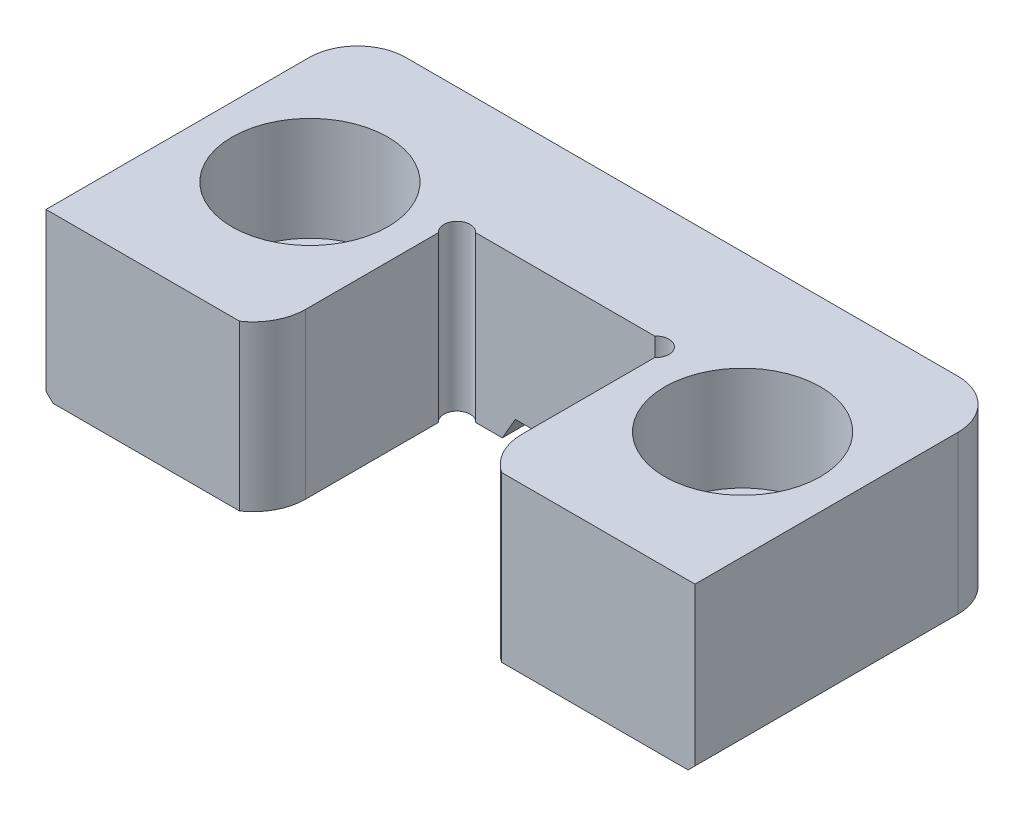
ISO-10303-21;
HEADER;
FILE_DESCRIPTION(('STEP AP214'),'2;1');
FILE_NAME('part.step','',(''),(''),'','','');
FILE_SCHEMA(('AUTOMOTIVE_DESIGN { 1 0 10303 214 1 1 1 1 }'));
ENDSEC;
DATA;
#1=APPLICATION_CONTEXT('core data for automotive mechanical design processes');
#2=APPLICATION_PROTOCOL_DEFINITION('international standard','automotive_design',2000,#1);
#3=PRODUCT_CONTEXT('',#1,'mechanical');
#4=PRODUCT('Part','Part','',(#3));
#5=PRODUCT_RELATED_PRODUCT_CATEGORY('part','',(#4));
#6=PRODUCT_DEFINITION_FORMATION('','',#4);
#7=PRODUCT_DEFINITION_CONTEXT('part definition',#1,'design');
#8=PRODUCT_DEFINITION('design','',#6,#7);
#9=PRODUCT_DEFINITION_SHAPE('','',#8);
#10=(LENGTH_UNIT() NAMED_UNIT(*) SI_UNIT(.MILLI.,.METRE.));
#11=(NAMED_UNIT(*) PLANE_ANGLE_UNIT() SI_UNIT($,.RADIAN.));
#12=(NAMED_UNIT(*) SI_UNIT($,.STERADIAN.) SOLID_ANGLE_UNIT());
#13=UNCERTAINTY_MEASURE_WITH_UNIT(LENGTH_MEASURE(1.E-05),#10,'distance_accuracy_value','');
#14=(GEOMETRIC_REPRESENTATION_CONTEXT(3) GLOBAL_UNCERTAINTY_ASSIGNED_CONTEXT((#13)) GLOBAL_UNIT_ASSIGNED_CONTEXT((#10,
#11,#12)) REPRESENTATION_CONTEXT('',''));
#15=CARTESIAN_POINT('',(0.,0.,0.));
#16=DIRECTION('',(0.,0.,1.));
#17=DIRECTION('',(1.,0.,0.));
#18=AXIS2_PLACEMENT_3D('',#15,#16,#17);
#19=CARTESIAN_POINT('',(-37.5,-19.,-36.));
#20=DIRECTION('',(0.,-1.,0.));
#21=DIRECTION('',(0.,0.,-1.));
#22=AXIS2_PLACEMENT_3D('',#19,#20,#21);
#23=PLANE('',#22);
#24=CARTESIAN_POINT('',(-25.,-19.,-18.));
#25=DIRECTION('',(0.,1.,0.));
#26=DIRECTION('',(0.,0.,1.));
#27=AXIS2_PLACEMENT_3D('',#24,#25,#26);
#28=CIRCLE('',#27,5.49999999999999);
#29=CARTESIAN_POINT('',(-25.,-19.,-12.5));
#30=VERTEX_POINT('',#29);
#31=EDGE_CURVE('E203',#30,#30,#28,.T.);
#32=ORIENTED_EDGE('',*,*,#31,.T.);
#33=EDGE_LOOP('',(#32));
#34=FACE_BOUND('',#33,.T.);
#35=CARTESIAN_POINT('',(-31.9,-19.,-30.4));
#36=DIRECTION('',(0.,-1.,0.));
#37=DIRECTION('',(0.,0.,-1.));
#38=AXIS2_PLACEMENT_3D('',#35,#36,#37);
#39=CIRCLE('',#38,4.79999999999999);
#40=CARTESIAN_POINT('',(-36.7,-19.,-30.4));
#41=VERTEX_POINT('',#40);
#42=CARTESIAN_POINT('',(-31.9,-19.,-35.2));
#43=VERTEX_POINT('',#42);
#44=EDGE_CURVE('E341',#41,#43,#39,.T.);
#45=ORIENTED_EDGE('',*,*,#44,.T.);
#46=DIRECTION('',(1.,0.,0.));
#47=VECTOR('',#46,1.);
#48=CARTESIAN_POINT('',(-37.5,-19.,-35.2));
#49=LINE('',#48,#47);
#50=CARTESIAN_POINT('',(-7.2679869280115,-19.,-35.2));
#51=VERTEX_POINT('',#50);
#52=EDGE_CURVE('E343',#43,#51,#49,.T.);
#53=ORIENTED_EDGE('',*,*,#52,.T.);
#54=DIRECTION('',(0.,0.,-1.));
#55=VECTOR('',#54,1.);
#56=CARTESIAN_POINT('',(-7.2679869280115,-19.,-36.));
#57=LINE('',#56,#55);
#58=CARTESIAN_POINT('',(-7.2679869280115,-19.,-22.5));
#59=VERTEX_POINT('',#58);
#60=EDGE_CURVE('E325',#59,#51,#57,.T.);
#61=ORIENTED_EDGE('',*,*,#60,.F.);
#62=DIRECTION('',(1.,0.,0.));
#63=VECTOR('',#62,1.);
#64=CARTESIAN_POINT('',(-12.499,-19.,-22.5));
#65=LINE('',#64,#63);
#66=CARTESIAN_POINT('',(-10.3530862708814,-19.,-22.5));
#67=VERTEX_POINT('',#66);
#68=EDGE_CURVE('E275',#67,#59,#65,.T.);
#69=ORIENTED_EDGE('',*,*,#68,.F.);
#70=CARTESIAN_POINT('',(-11.489,-19.,-21.49));
#71=DIRECTION('',(0.,1.,0.));
#72=DIRECTION('',(0.,0.,1.));
#73=AXIS2_PLACEMENT_3D('',#70,#71,#72);
#74=CIRCLE('',#73,1.52);
#75=CARTESIAN_POINT('',(-12.499,-19.,-20.3540862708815));
#76=VERTEX_POINT('',#75);
#77=EDGE_CURVE('E237',#67,#76,#74,.T.);
#78=ORIENTED_EDGE('',*,*,#77,.T.);
#79=DIRECTION('',(0.,0.,-1.));
#80=VECTOR('',#79,1.);
#81=CARTESIAN_POINT('',(-12.499,-19.,0.));
#82=LINE('',#81,#80);
#83=CARTESIAN_POINT('',(-12.499,-19.,-5.));
#84=VERTEX_POINT('',#83);
#85=EDGE_CURVE('E270',#84,#76,#82,.T.);
#86=ORIENTED_EDGE('',*,*,#85,.F.);
#87=CARTESIAN_POINT('',(-18.5522036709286,-19.,-5.));
#88=DIRECTION('',(0.,-1.,0.));
#89=DIRECTION('',(0.,0.,1.));
#90=AXIS2_PLACEMENT_3D('',#87,#88,#89);
#91=CIRCLE('',#90,6.05320367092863);
#92=CARTESIAN_POINT('',(-15.1402724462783,-19.,0.));
#93=VERTEX_POINT('',#92);
#94=EDGE_CURVE('E246',#84,#93,#91,.T.);
#95=ORIENTED_EDGE('',*,*,#94,.T.);
#96=DIRECTION('',(1.,0.,0.));
#97=VECTOR('',#96,1.);
#98=CARTESIAN_POINT('',(-37.5,-19.,0.));
#99=LINE('',#98,#97);
#100=CARTESIAN_POINT('',(-36.7,-19.,0.));
#101=VERTEX_POINT('',#100);
#102=EDGE_CURVE('E268',#101,#93,#99,.T.);
#103=ORIENTED_EDGE('',*,*,#102,.F.);
#104=DIRECTION('',(0.,0.,-1.));
#105=VECTOR('',#104,1.);
#106=CARTESIAN_POINT('',(-36.7,-19.,-36.));
#107=LINE('',#106,#105);
#108=EDGE_CURVE('E339',#101,#41,#107,.T.);
#109=ORIENTED_EDGE('',*,*,#108,.T.);
#110=EDGE_LOOP('',(#45,#53,#61,#69,#78,#86,#95,#103,#109));
#111=FACE_BOUND('',#110,.T.);
#112=ADVANCED_FACE('F35',(#34,#111),#23,.T.);
#113=CARTESIAN_POINT('',(-37.5,-19.,0.));
#114=DIRECTION('',(-1.,0.,0.));
#115=DIRECTION('',(0.,0.,1.));
#116=AXIS2_PLACEMENT_3D('',#113,#114,#115);
#117=PLANE('',#116);
#118=DIRECTION('',(0.,1.,0.));
#119=VECTOR('',#118,1.);
#120=CARTESIAN_POINT('',(-37.5,-19.,-30.4));
#121=LINE('',#120,#119);
#122=CARTESIAN_POINT('',(-37.5,0.,-30.4));
#123=VERTEX_POINT('',#122);
#124=CARTESIAN_POINT('',(-37.5,-18.2,-30.4));
#125=VERTEX_POINT('',#124);
#126=EDGE_CURVE('E317',#123,#125,#121,.F.);
#127=ORIENTED_EDGE('',*,*,#126,.T.);
#128=DIRECTION('',(0.,0.,1.));
#129=VECTOR('',#128,1.);
#130=CARTESIAN_POINT('',(-37.5,-18.2,0.));
#131=LINE('',#130,#129);
#132=CARTESIAN_POINT('',(-37.5,-18.2,0.));
#133=VERTEX_POINT('',#132);
#134=EDGE_CURVE('E348',#125,#133,#131,.T.);
#135=ORIENTED_EDGE('',*,*,#134,.T.);
#136=DIRECTION('',(0.,1.,0.));
#137=VECTOR('',#136,1.);
#138=CARTESIAN_POINT('',(-37.5,-19.,0.));
#139=LINE('',#138,#137);
#140=CARTESIAN_POINT('',(-37.5,0.,0.));
#141=VERTEX_POINT('',#140);
#142=EDGE_CURVE('E282',#133,#141,#139,.T.);
#143=ORIENTED_EDGE('',*,*,#142,.T.);
#144=DIRECTION('',(0.,0.,1.));
#145=VECTOR('',#144,1.);
#146=CARTESIAN_POINT('',(-37.5,0.,0.));
#147=LINE('',#146,#145);
#148=EDGE_CURVE('E260',#123,#141,#147,.T.);
#149=ORIENTED_EDGE('',*,*,#148,.F.);
#150=EDGE_LOOP('',(#127,#135,#143,#149));
#151=FACE_BOUND('',#150,.T.);
#152=ADVANCED_FACE('F444',(#151),#117,.T.);
#153=CARTESIAN_POINT('',(-37.5,-19.,-36.));
#154=DIRECTION('',(0.,0.,-1.));
#155=DIRECTION('',(-1.,0.,0.));
#156=AXIS2_PLACEMENT_3D('',#153,#154,#155);
#157=PLANE('',#156);
#158=DIRECTION('',(0.499999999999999,0.866025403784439,0.));
#159=VECTOR('',#158,1.);
#160=CARTESIAN_POINT('',(-6.35,-17.41,-36.));
#161=LINE('',#160,#159);
#162=CARTESIAN_POINT('',(-6.8061067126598,-18.2,-36.));
#163=VERTEX_POINT('',#162);
#164=CARTESIAN_POINT('',(-6.35,-17.41,-36.));
#165=VERTEX_POINT('',#164);
#166=EDGE_CURVE('E190',#163,#165,#161,.T.);
#167=ORIENTED_EDGE('',*,*,#166,.F.);
#168=DIRECTION('',(-1.,0.,0.));
#169=VECTOR('',#168,1.);
#170=CARTESIAN_POINT('',(-37.5,-18.2,-36.));
#171=LINE('',#170,#169);
#172=CARTESIAN_POINT('',(-31.9,-18.2,-36.));
#173=VERTEX_POINT('',#172);
#174=EDGE_CURVE('E337',#163,#173,#171,.T.);
#175=ORIENTED_EDGE('',*,*,#174,.T.);
#176=DIRECTION('',(0.,1.,0.));
#177=VECTOR('',#176,1.);
#178=CARTESIAN_POINT('',(-31.9,-19.,-36.));
#179=LINE('',#178,#177);
#180=CARTESIAN_POINT('',(-31.9,0.,-36.));
#181=VERTEX_POINT('',#180);
#182=EDGE_CURVE('E312',#173,#181,#179,.T.);
#183=ORIENTED_EDGE('',*,*,#182,.T.);
#184=DIRECTION('',(-1.,0.,0.));
#185=VECTOR('',#184,1.);
#186=CARTESIAN_POINT('',(-37.5,0.,-36.));
#187=LINE('',#186,#185);
#188=CARTESIAN_POINT('',(31.9,0.,-36.));
#189=VERTEX_POINT('',#188);
#190=EDGE_CURVE('E271',#189,#181,#187,.T.);
#191=ORIENTED_EDGE('',*,*,#190,.F.);
#192=DIRECTION('',(0.,1.,0.));
#193=VECTOR('',#192,1.);
#194=CARTESIAN_POINT('',(31.9,-19.,-36.));
#195=LINE('',#194,#193);
#196=CARTESIAN_POINT('',(31.9,-18.2,-36.));
#197=VERTEX_POINT('',#196);
#198=EDGE_CURVE('E314',#189,#197,#195,.F.);
#199=ORIENTED_EDGE('',*,*,#198,.T.);
#200=DIRECTION('',(-1.,0.,0.));
#201=VECTOR('',#200,1.);
#202=CARTESIAN_POINT('',(-37.5,-18.2,-36.));
#203=LINE('',#202,#201);
#204=CARTESIAN_POINT('',(6.80610671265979,-18.2,-36.));
#205=VERTEX_POINT('',#204);
#206=EDGE_CURVE('E335',#197,#205,#203,.T.);
#207=ORIENTED_EDGE('',*,*,#206,.T.);
#208=DIRECTION('',(0.499999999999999,-0.866025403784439,0.));
#209=VECTOR('',#208,1.);
#210=CARTESIAN_POINT('',(6.35,-17.41,-36.));
#211=LINE('',#210,#209);
#212=CARTESIAN_POINT('',(6.35,-17.41,-36.));
#213=VERTEX_POINT('',#212);
#214=EDGE_CURVE('E214',#213,#205,#211,.T.);
#215=ORIENTED_EDGE('',*,*,#214,.F.);
#216=DIRECTION('',(1.,0.,0.));
#217=VECTOR('',#216,1.);
#218=CARTESIAN_POINT('',(6.35,-17.41,-36.));
#219=LINE('',#218,#217);
#220=EDGE_CURVE('E202',#165,#213,#219,.T.);
#221=ORIENTED_EDGE('',*,*,#220,.F.);
#222=EDGE_LOOP('',(#167,#175,#183,#191,#199,#207,#215,#221));
#223=FACE_BOUND('',#222,.T.);
#224=ADVANCED_FACE('F216',(#223),#157,.T.);
#225=CARTESIAN_POINT('',(37.5,-19.,0.));
#226=DIRECTION('',(1.,0.,0.));
#227=DIRECTION('',(0.,0.,-1.));
#228=AXIS2_PLACEMENT_3D('',#225,#226,#227);
#229=PLANE('',#228);
#230=DIRECTION('',(0.,1.,0.));
#231=VECTOR('',#230,1.);
#232=CARTESIAN_POINT('',(37.5,-19.,0.));
#233=LINE('',#232,#231);
#234=CARTESIAN_POINT('',(37.5,-18.2,0.));
#235=VERTEX_POINT('',#234);
#236=CARTESIAN_POINT('',(37.5,0.,0.));
#237=VERTEX_POINT('',#236);
#238=EDGE_CURVE('E303',#235,#237,#233,.T.);
#239=ORIENTED_EDGE('',*,*,#238,.F.);
#240=DIRECTION('',(0.,0.,-1.));
#241=VECTOR('',#240,1.);
#242=CARTESIAN_POINT('',(37.5,-18.2,0.));
#243=LINE('',#242,#241);
#244=CARTESIAN_POINT('',(37.5,-18.2,-30.4));
#245=VERTEX_POINT('',#244);
#246=EDGE_CURVE('E44',#235,#245,#243,.T.);
#247=ORIENTED_EDGE('',*,*,#246,.T.);
#248=DIRECTION('',(0.,1.,0.));
#249=VECTOR('',#248,1.);
#250=CARTESIAN_POINT('',(37.5,-19.,-30.4));
#251=LINE('',#250,#249);
#252=CARTESIAN_POINT('',(37.5,0.,-30.4));
#253=VERTEX_POINT('',#252);
#254=EDGE_CURVE('E305',#245,#253,#251,.T.);
#255=ORIENTED_EDGE('',*,*,#254,.T.);
#256=DIRECTION('',(0.,0.,-1.));
#257=VECTOR('',#256,1.);
#258=CARTESIAN_POINT('',(37.5,0.,0.));
#259=LINE('',#258,#257);
#260=EDGE_CURVE('E298',#237,#253,#259,.T.);
#261=ORIENTED_EDGE('',*,*,#260,.F.);
#262=EDGE_LOOP('',(#239,#247,#255,#261));
#263=FACE_BOUND('',#262,.T.);
#264=ADVANCED_FACE('F436',(#263),#229,.T.);
#265=CARTESIAN_POINT('',(12.499,-19.,0.));
#266=DIRECTION('',(0.,0.,1.));
#267=DIRECTION('',(1.,0.,0.));
#268=AXIS2_PLACEMENT_3D('',#265,#266,#267);
#269=PLANE('',#268);
#270=DIRECTION('',(1.,0.,0.));
#271=VECTOR('',#270,1.);
#272=CARTESIAN_POINT('',(12.499,-19.,0.));
#273=LINE('',#272,#271);
#274=CARTESIAN_POINT('',(15.1402724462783,-19.,0.));
#275=VERTEX_POINT('',#274);
#276=CARTESIAN_POINT('',(36.7,-19.,0.));
#277=VERTEX_POINT('',#276);
#278=EDGE_CURVE('E280',#275,#277,#273,.T.);
#279=ORIENTED_EDGE('',*,*,#278,.T.);
#280=DIRECTION('',(-0.707106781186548,-0.707106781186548,0.));
#281=VECTOR('',#280,1.);
#282=CARTESIAN_POINT('',(24.5995,-31.1005,0.));
#283=LINE('',#282,#281);
#284=EDGE_CURVE('E11',#277,#235,#283,.F.);
#285=ORIENTED_EDGE('',*,*,#284,.T.);
#286=ORIENTED_EDGE('',*,*,#238,.T.);
#287=DIRECTION('',(1.,0.,0.));
#288=VECTOR('',#287,1.);
#289=CARTESIAN_POINT('',(12.499,0.,0.));
#290=LINE('',#289,#288);
#291=CARTESIAN_POINT('',(15.1402724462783,0.,0.));
#292=VERTEX_POINT('',#291);
#293=EDGE_CURVE('E295',#292,#237,#290,.T.);
#294=ORIENTED_EDGE('',*,*,#293,.F.);
#295=DIRECTION('',(0.,1.,0.));
#296=VECTOR('',#295,1.);
#297=CARTESIAN_POINT('',(15.1402724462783,-19.,0.));
#298=LINE('',#297,#296);
#299=EDGE_CURVE('E264',#275,#292,#298,.T.);
#300=ORIENTED_EDGE('',*,*,#299,.F.);
#301=EDGE_LOOP('',(#279,#285,#286,#294,#300));
#302=FACE_BOUND('',#301,.T.);
#303=ADVANCED_FACE('F387',(#302),#269,.T.);
#304=CARTESIAN_POINT('',(12.499,-19.,0.));
#305=DIRECTION('',(-1.,0.,0.));
#306=DIRECTION('',(0.,0.,1.));
#307=AXIS2_PLACEMENT_3D('',#304,#305,#306);
#308=PLANE('',#307);
#309=DIRECTION('',(0.,1.,0.));
#310=VECTOR('',#309,1.);
#311=CARTESIAN_POINT('',(12.499,-19.,-20.3540862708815));
#312=LINE('',#311,#310);
#313=CARTESIAN_POINT('',(12.499,-19.,-20.3540862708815));
#314=VERTEX_POINT('',#313);
#315=CARTESIAN_POINT('',(12.499,0.,-20.3540862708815));
#316=VERTEX_POINT('',#315);
#317=EDGE_CURVE('E234',#314,#316,#312,.T.);
#318=ORIENTED_EDGE('',*,*,#317,.F.);
#319=DIRECTION('',(0.,0.,1.));
#320=VECTOR('',#319,1.);
#321=CARTESIAN_POINT('',(12.499,-19.,0.));
#322=LINE('',#321,#320);
#323=CARTESIAN_POINT('',(12.499,-19.,-5.));
#324=VERTEX_POINT('',#323);
#325=EDGE_CURVE('E278',#314,#324,#322,.T.);
#326=ORIENTED_EDGE('',*,*,#325,.T.);
#327=DIRECTION('',(0.,1.,0.));
#328=VECTOR('',#327,1.);
#329=CARTESIAN_POINT('',(12.499,-19.,-5.));
#330=LINE('',#329,#328);
#331=CARTESIAN_POINT('',(12.499,0.,-5.));
#332=VERTEX_POINT('',#331);
#333=EDGE_CURVE('E261',#324,#332,#330,.T.);
#334=ORIENTED_EDGE('',*,*,#333,.T.);
#335=DIRECTION('',(0.,0.,1.));
#336=VECTOR('',#335,1.);
#337=CARTESIAN_POINT('',(12.499,0.,0.));
#338=LINE('',#337,#336);
#339=EDGE_CURVE('E293',#316,#332,#338,.T.);
#340=ORIENTED_EDGE('',*,*,#339,.F.);
#341=EDGE_LOOP('',(#318,#326,#334,#340));
#342=FACE_BOUND('',#341,.T.);
#343=ADVANCED_FACE('F399',(#342),#308,.T.);
#344=CARTESIAN_POINT('',(-12.499,-19.,-22.5));
#345=DIRECTION('',(0.,0.,1.));
#346=DIRECTION('',(1.,0.,0.));
#347=AXIS2_PLACEMENT_3D('',#344,#345,#346);
#348=PLANE('',#347);
#349=DIRECTION('',(-0.499999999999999,-0.866025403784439,0.));
#350=VECTOR('',#349,1.);
#351=CARTESIAN_POINT('',(-8.57574019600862,-21.2650951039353,-22.5));
#352=LINE('',#351,#350);
#353=CARTESIAN_POINT('',(-5.76213795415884,-16.3917930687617,-22.5));
#354=VERTEX_POINT('',#353);
#355=EDGE_CURVE('E226',#354,#59,#352,.T.);
#356=ORIENTED_EDGE('',*,*,#355,.F.);
#357=DIRECTION('',(1.,0.,0.));
#358=VECTOR('',#357,1.);
#359=CARTESIAN_POINT('',(6.35,-16.3917930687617,-22.5));
#360=LINE('',#359,#358);
#361=CARTESIAN_POINT('',(5.76213795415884,-16.3917930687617,-22.5));
#362=VERTEX_POINT('',#361);
#363=EDGE_CURVE('E328',#354,#362,#360,.T.);
#364=ORIENTED_EDGE('',*,*,#363,.T.);
#365=DIRECTION('',(-0.499999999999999,0.866025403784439,0.));
#366=VECTOR('',#365,1.);
#367=CARTESIAN_POINT('',(2.32624019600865,-10.4406435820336,-22.5));
#368=LINE('',#367,#366);
#369=CARTESIAN_POINT('',(7.2679869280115,-19.,-22.5));
#370=VERTEX_POINT('',#369);
#371=EDGE_CURVE('E223',#370,#362,#368,.T.);
#372=ORIENTED_EDGE('',*,*,#371,.F.);
#373=CARTESIAN_POINT('',(10.3530862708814,-19.,-22.5));
#374=VERTEX_POINT('',#373);
#375=EDGE_CURVE('E274',#370,#374,#65,.T.);
#376=ORIENTED_EDGE('',*,*,#375,.T.);
#377=DIRECTION('',(0.,1.,0.));
#378=VECTOR('',#377,1.);
#379=CARTESIAN_POINT('',(10.3530862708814,-19.,-22.5));
#380=LINE('',#379,#378);
#381=CARTESIAN_POINT('',(10.3530862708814,0.,-22.5));
#382=VERTEX_POINT('',#381);
#383=EDGE_CURVE('E231',#382,#374,#380,.F.);
#384=ORIENTED_EDGE('',*,*,#383,.F.);
#385=DIRECTION('',(1.,0.,0.));
#386=VECTOR('',#385,1.);
#387=CARTESIAN_POINT('',(-12.499,0.,-22.5));
#388=LINE('',#387,#386);
#389=CARTESIAN_POINT('',(-10.3530862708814,0.,-22.5));
#390=VERTEX_POINT('',#389);
#391=EDGE_CURVE('E290',#390,#382,#388,.T.);
#392=ORIENTED_EDGE('',*,*,#391,.F.);
#393=DIRECTION('',(0.,1.,0.));
#394=VECTOR('',#393,1.);
#395=CARTESIAN_POINT('',(-10.3530862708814,-19.,-22.5));
#396=LINE('',#395,#394);
#397=EDGE_CURVE('E243',#67,#390,#396,.T.);
#398=ORIENTED_EDGE('',*,*,#397,.F.);
#399=ORIENTED_EDGE('',*,*,#68,.T.);
#400=EDGE_LOOP('',(#356,#364,#372,#376,#384,#392,#398,#399));
#401=FACE_BOUND('',#400,.T.);
#402=ADVANCED_FACE('F407',(#401),#348,.T.);
#403=CARTESIAN_POINT('',(-12.499,-19.,0.));
#404=DIRECTION('',(1.,0.,0.));
#405=DIRECTION('',(0.,0.,-1.));
#406=AXIS2_PLACEMENT_3D('',#403,#404,#405);
#407=PLANE('',#406);
#408=DIRECTION('',(0.,1.,0.));
#409=VECTOR('',#408,1.);
#410=CARTESIAN_POINT('',(-12.499,-19.,-20.3540862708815));
#411=LINE('',#410,#409);
#412=CARTESIAN_POINT('',(-12.499,0.,-20.3540862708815));
#413=VERTEX_POINT('',#412);
#414=EDGE_CURVE('E240',#413,#76,#411,.F.);
#415=ORIENTED_EDGE('',*,*,#414,.F.);
#416=DIRECTION('',(0.,0.,-1.));
#417=VECTOR('',#416,1.);
#418=CARTESIAN_POINT('',(-12.499,0.,0.));
#419=LINE('',#418,#417);
#420=CARTESIAN_POINT('',(-12.499,0.,-5.));
#421=VERTEX_POINT('',#420);
#422=EDGE_CURVE('E287',#421,#413,#419,.T.);
#423=ORIENTED_EDGE('',*,*,#422,.F.);
#424=DIRECTION('',(0.,1.,0.));
#425=VECTOR('',#424,1.);
#426=CARTESIAN_POINT('',(-12.499,-19.,-5.));
#427=LINE('',#426,#425);
#428=EDGE_CURVE('E258',#84,#421,#427,.T.);
#429=ORIENTED_EDGE('',*,*,#428,.F.);
#430=ORIENTED_EDGE('',*,*,#85,.T.);
#431=EDGE_LOOP('',(#415,#423,#429,#430));
#432=FACE_BOUND('',#431,.T.);
#433=ADVANCED_FACE('F417',(#432),#407,.T.);
#434=CARTESIAN_POINT('',(-37.5,-19.,0.));
#435=DIRECTION('',(0.,0.,1.));
#436=DIRECTION('',(1.,0.,0.));
#437=AXIS2_PLACEMENT_3D('',#434,#435,#436);
#438=PLANE('',#437);
#439=ORIENTED_EDGE('',*,*,#142,.F.);
#440=DIRECTION('',(-0.707106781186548,0.707106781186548,0.));
#441=VECTOR('',#440,1.);
#442=CARTESIAN_POINT('',(-37.1,-18.6,0.));
#443=LINE('',#442,#441);
#444=EDGE_CURVE('E350',#133,#101,#443,.F.);
#445=ORIENTED_EDGE('',*,*,#444,.T.);
#446=ORIENTED_EDGE('',*,*,#102,.T.);
#447=DIRECTION('',(0.,1.,0.));
#448=VECTOR('',#447,1.);
#449=CARTESIAN_POINT('',(-15.1402724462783,-19.,0.));
#450=LINE('',#449,#448);
#451=CARTESIAN_POINT('',(-15.1402724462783,0.,0.));
#452=VERTEX_POINT('',#451);
#453=EDGE_CURVE('E253',#93,#452,#450,.T.);
#454=ORIENTED_EDGE('',*,*,#453,.T.);
#455=DIRECTION('',(1.,0.,0.));
#456=VECTOR('',#455,1.);
#457=CARTESIAN_POINT('',(-37.5,0.,0.));
#458=LINE('',#457,#456);
#459=EDGE_CURVE('E285',#141,#452,#458,.T.);
#460=ORIENTED_EDGE('',*,*,#459,.F.);
#461=EDGE_LOOP('',(#439,#445,#446,#454,#460));
#462=FACE_BOUND('',#461,.T.);
#463=ADVANCED_FACE('F462',(#462),#438,.T.);
#464=CARTESIAN_POINT('',(25.,-19.,-18.));
#465=DIRECTION('',(0.,1.,0.));
#466=DIRECTION('',(0.,0.,1.));
#467=AXIS2_PLACEMENT_3D('',#464,#465,#466);
#468=CIRCLE('',#467,5.49999999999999);
#469=CARTESIAN_POINT('',(25.,-19.,-12.5));
#470=VERTEX_POINT('',#469);
#471=EDGE_CURVE('E493',#470,#470,#468,.T.);
#472=ORIENTED_EDGE('',*,*,#471,.T.);
#473=EDGE_LOOP('',(#472));
#474=FACE_BOUND('',#473,.T.);
#475=DIRECTION('',(0.,0.,1.));
#476=VECTOR('',#475,1.);
#477=CARTESIAN_POINT('',(7.2679869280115,-19.,-36.));
#478=LINE('',#477,#476);
#479=CARTESIAN_POINT('',(7.2679869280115,-19.,-35.2));
#480=VERTEX_POINT('',#479);
#481=EDGE_CURVE('E323',#480,#370,#478,.T.);
#482=ORIENTED_EDGE('',*,*,#481,.F.);
#483=DIRECTION('',(1.,0.,0.));
#484=VECTOR('',#483,1.);
#485=CARTESIAN_POINT('',(-37.5,-19.,-35.2));
#486=LINE('',#485,#484);
#487=CARTESIAN_POINT('',(31.9,-19.,-35.2));
#488=VERTEX_POINT('',#487);
#489=EDGE_CURVE('E358',#480,#488,#486,.T.);
#490=ORIENTED_EDGE('',*,*,#489,.T.);
#491=CARTESIAN_POINT('',(31.9,-19.,-30.4));
#492=DIRECTION('',(0.,-1.,0.));
#493=DIRECTION('',(0.,0.,-1.));
#494=AXIS2_PLACEMENT_3D('',#491,#492,#493);
#495=CIRCLE('',#494,4.79999999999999);
#496=CARTESIAN_POINT('',(36.7,-19.,-30.4));
#497=VERTEX_POINT('',#496);
#498=EDGE_CURVE('E356',#488,#497,#495,.T.);
#499=ORIENTED_EDGE('',*,*,#498,.T.);
#500=DIRECTION('',(0.,0.,1.));
#501=VECTOR('',#500,1.);
#502=CARTESIAN_POINT('',(36.7,-19.,-36.));
#503=LINE('',#502,#501);
#504=EDGE_CURVE('E354',#497,#277,#503,.T.);
#505=ORIENTED_EDGE('',*,*,#504,.T.);
#506=ORIENTED_EDGE('',*,*,#278,.F.);
#507=CARTESIAN_POINT('',(18.5522036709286,-19.,-5.));
#508=DIRECTION('',(0.,-1.,0.));
#509=DIRECTION('',(0.,0.,-1.));
#510=AXIS2_PLACEMENT_3D('',#507,#508,#509);
#511=CIRCLE('',#510,6.05320367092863);
#512=EDGE_CURVE('E249',#275,#324,#511,.T.);
#513=ORIENTED_EDGE('',*,*,#512,.T.);
#514=ORIENTED_EDGE('',*,*,#325,.F.);
#515=CARTESIAN_POINT('',(11.489,-19.,-21.49));
#516=DIRECTION('',(0.,1.,0.));
#517=DIRECTION('',(0.,0.,-1.));
#518=AXIS2_PLACEMENT_3D('',#515,#516,#517);
#519=CIRCLE('',#518,1.52);
#520=EDGE_CURVE('E228',#314,#374,#519,.T.);
#521=ORIENTED_EDGE('',*,*,#520,.T.);
#522=ORIENTED_EDGE('',*,*,#375,.F.);
#523=EDGE_LOOP('',(#482,#490,#499,#505,#506,#513,#514,#521,#522));
#524=FACE_BOUND('',#523,.T.);
#525=ADVANCED_FACE('F385',(#474,#524),#23,.T.);
#526=CARTESIAN_POINT('',(-37.5,0.,-36.));
#527=DIRECTION('',(0.,-1.,0.));
#528=DIRECTION('',(0.,0.,-1.));
#529=AXIS2_PLACEMENT_3D('',#526,#527,#528);
#530=PLANE('',#529);
#531=CARTESIAN_POINT('',(25.,0.,-18.));
#532=DIRECTION('',(0.,1.,0.));
#533=DIRECTION('',(0.,0.,1.));
#534=AXIS2_PLACEMENT_3D('',#531,#532,#533);
#535=CIRCLE('',#534,9.);
#536=CARTESIAN_POINT('',(25.,0.,-9.));
#537=VERTEX_POINT('',#536);
#538=EDGE_CURVE('E367',#537,#537,#535,.T.);
#539=ORIENTED_EDGE('',*,*,#538,.F.);
#540=EDGE_LOOP('',(#539));
#541=FACE_BOUND('',#540,.T.);
#542=CARTESIAN_POINT('',(-25.,0.,-18.));
#543=DIRECTION('',(0.,1.,0.));
#544=DIRECTION('',(0.,0.,1.));
#545=AXIS2_PLACEMENT_3D('',#542,#543,#544);
#546=CIRCLE('',#545,9.);
#547=CARTESIAN_POINT('',(-25.,0.,-9.));
#548=VERTEX_POINT('',#547);
#549=EDGE_CURVE('E495',#548,#548,#546,.T.);
#550=ORIENTED_EDGE('',*,*,#549,.F.);
#551=EDGE_LOOP('',(#550));
#552=FACE_BOUND('',#551,.T.);
#553=ORIENTED_EDGE('',*,*,#391,.T.);
#554=CARTESIAN_POINT('',(11.489,0.,-21.49));
#555=DIRECTION('',(0.,-1.,0.));
#556=DIRECTION('',(0.,0.,-1.));
#557=AXIS2_PLACEMENT_3D('',#554,#555,#556);
#558=CIRCLE('',#557,1.52);
#559=EDGE_CURVE('E320',#382,#316,#558,.T.);
#560=ORIENTED_EDGE('',*,*,#559,.T.);
#561=ORIENTED_EDGE('',*,*,#339,.T.);
#562=CARTESIAN_POINT('',(18.5522036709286,0.,-5.));
#563=DIRECTION('',(0.,-1.,0.));
#564=DIRECTION('',(0.,0.,-1.));
#565=AXIS2_PLACEMENT_3D('',#562,#563,#564);
#566=CIRCLE('',#565,6.05320367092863);
#567=EDGE_CURVE('E250',#292,#332,#566,.T.);
#568=ORIENTED_EDGE('',*,*,#567,.F.);
#569=ORIENTED_EDGE('',*,*,#293,.T.);
#570=ORIENTED_EDGE('',*,*,#260,.T.);
#571=CARTESIAN_POINT('',(31.9,0.,-30.4));
#572=DIRECTION('',(0.,-1.,0.));
#573=DIRECTION('',(0.,0.,-1.));
#574=AXIS2_PLACEMENT_3D('',#571,#572,#573);
#575=CIRCLE('',#574,5.6);
#576=EDGE_CURVE('E310',#253,#189,#575,.F.);
#577=ORIENTED_EDGE('',*,*,#576,.T.);
#578=ORIENTED_EDGE('',*,*,#190,.T.);
#579=CARTESIAN_POINT('',(-31.9,0.,-30.4));
#580=DIRECTION('',(0.,-1.,0.));
#581=DIRECTION('',(0.,0.,-1.));
#582=AXIS2_PLACEMENT_3D('',#579,#580,#581);
#583=CIRCLE('',#582,5.6);
#584=EDGE_CURVE('E308',#181,#123,#583,.F.);
#585=ORIENTED_EDGE('',*,*,#584,.T.);
#586=ORIENTED_EDGE('',*,*,#148,.T.);
#587=ORIENTED_EDGE('',*,*,#459,.T.);
#588=CARTESIAN_POINT('',(-18.5522036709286,0.,-5.));
#589=DIRECTION('',(0.,-1.,0.));
#590=DIRECTION('',(0.,0.,1.));
#591=AXIS2_PLACEMENT_3D('',#588,#589,#590);
#592=CIRCLE('',#591,6.05320367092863);
#593=EDGE_CURVE('E245',#421,#452,#592,.T.);
#594=ORIENTED_EDGE('',*,*,#593,.F.);
#595=ORIENTED_EDGE('',*,*,#422,.T.);
#596=CARTESIAN_POINT('',(-11.489,0.,-21.49));
#597=DIRECTION('',(0.,1.,0.));
#598=DIRECTION('',(0.,0.,1.));
#599=AXIS2_PLACEMENT_3D('',#596,#597,#598);
#600=CIRCLE('',#599,1.52);
#601=EDGE_CURVE('E236',#390,#413,#600,.T.);
#602=ORIENTED_EDGE('',*,*,#601,.F.);
#603=EDGE_LOOP('',(#553,#560,#561,#568,#569,#570,#577,#578,#585,#586,#587,#594,#595,#602));
#604=FACE_BOUND('',#603,.T.);
#605=ADVANCED_FACE('F394',(#541,#552,#604),#530,.F.);
#606=CARTESIAN_POINT('',(31.9,-19.,-30.4));
#607=DIRECTION('',(0.,1.,0.));
#608=DIRECTION('',(0.,0.,1.));
#609=AXIS2_PLACEMENT_3D('',#606,#607,#608);
#610=CYLINDRICAL_SURFACE('',#609,5.6);
#611=ORIENTED_EDGE('',*,*,#254,.F.);
#612=CARTESIAN_POINT('',(31.9,-18.2,-30.4));
#613=DIRECTION('',(0.,-1.,0.));
#614=DIRECTION('',(0.,0.,-1.));
#615=AXIS2_PLACEMENT_3D('',#612,#613,#614);
#616=CIRCLE('',#615,5.6);
#617=EDGE_CURVE('E360',#245,#197,#616,.F.);
#618=ORIENTED_EDGE('',*,*,#617,.T.);
#619=ORIENTED_EDGE('',*,*,#198,.F.);
#620=ORIENTED_EDGE('',*,*,#576,.F.);
#621=EDGE_LOOP('',(#611,#618,#619,#620));
#622=FACE_BOUND('',#621,.T.);
#623=ADVANCED_FACE('F435',(#622),#610,.T.);
#624=CARTESIAN_POINT('',(-31.9,-19.,-30.4));
#625=DIRECTION('',(0.,1.,0.));
#626=DIRECTION('',(0.,0.,1.));
#627=AXIS2_PLACEMENT_3D('',#624,#625,#626);
#628=CYLINDRICAL_SURFACE('',#627,5.6);
#629=ORIENTED_EDGE('',*,*,#182,.F.);
#630=CARTESIAN_POINT('',(-31.9,-18.2,-30.4));
#631=DIRECTION('',(0.,-1.,0.));
#632=DIRECTION('',(0.,0.,-1.));
#633=AXIS2_PLACEMENT_3D('',#630,#631,#632);
#634=CIRCLE('',#633,5.6);
#635=EDGE_CURVE('E346',#173,#125,#634,.F.);
#636=ORIENTED_EDGE('',*,*,#635,.T.);
#637=ORIENTED_EDGE('',*,*,#126,.F.);
#638=ORIENTED_EDGE('',*,*,#584,.F.);
#639=EDGE_LOOP('',(#629,#636,#637,#638));
#640=FACE_BOUND('',#639,.T.);
#641=ADVANCED_FACE('F447',(#640),#628,.T.);
#642=CARTESIAN_POINT('',(18.5522036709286,-19.,-5.));
#643=DIRECTION('',(0.,1.,0.));
#644=DIRECTION('',(0.,0.,1.));
#645=AXIS2_PLACEMENT_3D('',#642,#643,#644);
#646=CYLINDRICAL_SURFACE('',#645,6.05320367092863);
#647=ORIENTED_EDGE('',*,*,#567,.T.);
#648=ORIENTED_EDGE('',*,*,#333,.F.);
#649=ORIENTED_EDGE('',*,*,#512,.F.);
#650=ORIENTED_EDGE('',*,*,#299,.T.);
#651=EDGE_LOOP('',(#647,#648,#649,#650));
#652=FACE_BOUND('',#651,.T.);
#653=ADVANCED_FACE('F391',(#652),#646,.T.);
#654=CARTESIAN_POINT('',(-18.5522036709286,-19.,-5.));
#655=DIRECTION('',(0.,1.,0.));
#656=DIRECTION('',(0.,0.,1.));
#657=AXIS2_PLACEMENT_3D('',#654,#655,#656);
#658=CYLINDRICAL_SURFACE('',#657,6.05320367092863);
#659=ORIENTED_EDGE('',*,*,#593,.T.);
#660=ORIENTED_EDGE('',*,*,#453,.F.);
#661=ORIENTED_EDGE('',*,*,#94,.F.);
#662=ORIENTED_EDGE('',*,*,#428,.T.);
#663=EDGE_LOOP('',(#659,#660,#661,#662));
#664=FACE_BOUND('',#663,.T.);
#665=ADVANCED_FACE('F465',(#664),#658,.T.);
#666=CARTESIAN_POINT('',(-11.489,-19.,-21.49));
#667=DIRECTION('',(0.,1.,0.));
#668=DIRECTION('',(0.,0.,1.));
#669=AXIS2_PLACEMENT_3D('',#666,#667,#668);
#670=CYLINDRICAL_SURFACE('',#669,1.52);
#671=ORIENTED_EDGE('',*,*,#397,.T.);
#672=ORIENTED_EDGE('',*,*,#601,.T.);
#673=ORIENTED_EDGE('',*,*,#414,.T.);
#674=ORIENTED_EDGE('',*,*,#77,.F.);
#675=EDGE_LOOP('',(#671,#672,#673,#674));
#676=FACE_BOUND('',#675,.T.);
#677=ADVANCED_FACE('F415',(#676),#670,.F.);
#678=CARTESIAN_POINT('',(11.489,-19.,-21.49));
#679=DIRECTION('',(0.,1.,0.));
#680=DIRECTION('',(0.,0.,1.));
#681=AXIS2_PLACEMENT_3D('',#678,#679,#680);
#682=CYLINDRICAL_SURFACE('',#681,1.52);
#683=ORIENTED_EDGE('',*,*,#317,.T.);
#684=ORIENTED_EDGE('',*,*,#559,.F.);
#685=ORIENTED_EDGE('',*,*,#383,.T.);
#686=ORIENTED_EDGE('',*,*,#520,.F.);
#687=EDGE_LOOP('',(#683,#684,#685,#686));
#688=FACE_BOUND('',#687,.T.);
#689=ADVANCED_FACE('F403',(#688),#682,.F.);
#690=CARTESIAN_POINT('',(-6.35,-17.41,0.));
#691=DIRECTION('',(-0.866025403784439,0.499999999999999,0.));
#692=DIRECTION('',(-0.499999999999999,-0.866025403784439,0.));
#693=AXIS2_PLACEMENT_3D('',#690,#691,#692);
#694=PLANE('',#693);
#695=ORIENTED_EDGE('',*,*,#60,.T.);
#696=DIRECTION('',(-0.377964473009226,-0.654653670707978,0.654653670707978));
#697=VECTOR('',#696,1.);
#698=CARTESIAN_POINT('',(-11.1909486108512,-25.7947689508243,-28.4052310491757));
#699=LINE('',#698,#697);
#700=EDGE_CURVE('E197',#51,#163,#699,.F.);
#701=ORIENTED_EDGE('',*,*,#700,.T.);
#702=ORIENTED_EDGE('',*,*,#166,.T.);
#703=DIRECTION('',(0.,0.,-1.));
#704=VECTOR('',#703,1.);
#705=CARTESIAN_POINT('',(-6.35,-17.41,0.));
#706=LINE('',#705,#704);
#707=CARTESIAN_POINT('',(-6.35,-17.41,-26.3000000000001));
#708=VERTEX_POINT('',#707);
#709=EDGE_CURVE('E195',#708,#165,#706,.T.);
#710=ORIENTED_EDGE('',*,*,#709,.F.);
#711=DIRECTION('',(0.147788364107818,0.25597695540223,0.955319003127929));
#712=VECTOR('',#711,1.);
#713=CARTESIAN_POINT('',(-2.63683364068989,-10.9786072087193,-2.29771533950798));
#714=LINE('',#713,#712);
#715=EDGE_CURVE('E331',#708,#354,#714,.T.);
#716=ORIENTED_EDGE('',*,*,#715,.T.);
#717=ORIENTED_EDGE('',*,*,#355,.T.);
#718=EDGE_LOOP('',(#695,#701,#702,#710,#716,#717));
#719=FACE_BOUND('',#718,.T.);
#720=ADVANCED_FACE('F193',(#719),#694,.F.);
#721=CARTESIAN_POINT('',(6.35,-17.41,0.));
#722=DIRECTION('',(0.866025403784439,0.499999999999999,0.));
#723=DIRECTION('',(-0.499999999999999,0.866025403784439,0.));
#724=AXIS2_PLACEMENT_3D('',#721,#722,#723);
#725=PLANE('',#724);
#726=ORIENTED_EDGE('',*,*,#214,.T.);
#727=DIRECTION('',(-0.377964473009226,0.654653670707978,-0.654653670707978));
#728=VECTOR('',#727,1.);
#729=CARTESIAN_POINT('',(0.476662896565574,-7.23708172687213,-46.9629182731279));
#730=LINE('',#729,#728);
#731=EDGE_CURVE('E352',#205,#480,#730,.F.);
#732=ORIENTED_EDGE('',*,*,#731,.T.);
#733=ORIENTED_EDGE('',*,*,#481,.T.);
#734=ORIENTED_EDGE('',*,*,#371,.T.);
#735=DIRECTION('',(0.147788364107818,-0.25597695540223,-0.955319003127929));
#736=VECTOR('',#735,1.);
#737=CARTESIAN_POINT('',(2.63683364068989,-10.9786072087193,-2.29771533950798));
#738=LINE('',#737,#736);
#739=CARTESIAN_POINT('',(6.35,-17.41,-26.3000000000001));
#740=VERTEX_POINT('',#739);
#741=EDGE_CURVE('E333',#362,#740,#738,.T.);
#742=ORIENTED_EDGE('',*,*,#741,.T.);
#743=DIRECTION('',(0.,0.,-1.));
#744=VECTOR('',#743,1.);
#745=CARTESIAN_POINT('',(6.35,-17.41,0.));
#746=LINE('',#745,#744);
#747=EDGE_CURVE('E213',#740,#213,#746,.T.);
#748=ORIENTED_EDGE('',*,*,#747,.T.);
#749=EDGE_LOOP('',(#726,#732,#733,#734,#742,#748));
#750=FACE_BOUND('',#749,.T.);
#751=ADVANCED_FACE('F429',(#750),#725,.F.);
#752=CARTESIAN_POINT('',(6.35,-17.41,0.));
#753=DIRECTION('',(0.,1.,0.));
#754=DIRECTION('',(0.,0.,1.));
#755=AXIS2_PLACEMENT_3D('',#752,#753,#754);
#756=PLANE('',#755);
#757=ORIENTED_EDGE('',*,*,#747,.F.);
#758=DIRECTION('',(-1.,0.,0.));
#759=VECTOR('',#758,1.);
#760=CARTESIAN_POINT('',(-6.35,-17.41,-26.3000000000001));
#761=LINE('',#760,#759);
#762=EDGE_CURVE('E212',#740,#708,#761,.T.);
#763=ORIENTED_EDGE('',*,*,#762,.T.);
#764=ORIENTED_EDGE('',*,*,#709,.T.);
#765=ORIENTED_EDGE('',*,*,#220,.T.);
#766=EDGE_LOOP('',(#757,#763,#764,#765));
#767=FACE_BOUND('',#766,.T.);
#768=ADVANCED_FACE('F209',(#767),#756,.F.);
#769=CARTESIAN_POINT('',(6.35,-17.41,-26.3000000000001));
#770=DIRECTION('',(0.,-0.965925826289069,0.258819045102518));
#771=DIRECTION('',(0.,-0.258819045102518,-0.965925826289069));
#772=AXIS2_PLACEMENT_3D('',#769,#770,#771);
#773=PLANE('',#772);
#774=ORIENTED_EDGE('',*,*,#741,.F.);
#775=ORIENTED_EDGE('',*,*,#363,.F.);
#776=ORIENTED_EDGE('',*,*,#715,.F.);
#777=ORIENTED_EDGE('',*,*,#762,.F.);
#778=EDGE_LOOP('',(#774,#775,#776,#777));
#779=FACE_BOUND('',#778,.T.);
#780=ADVANCED_FACE('F427',(#779),#773,.T.);
#781=CARTESIAN_POINT('',(-25.,0.,-18.));
#782=DIRECTION('',(0.,1.,0.));
#783=DIRECTION('',(0.,0.,1.));
#784=AXIS2_PLACEMENT_3D('',#781,#782,#783);
#785=CYLINDRICAL_SURFACE('',#784,5.5);
#786=ORIENTED_EDGE('',*,*,#31,.F.);
#787=EDGE_LOOP('',(#786));
#788=FACE_BOUND('',#787,.T.);
#789=CARTESIAN_POINT('',(-25.,-12.,-18.));
#790=DIRECTION('',(0.,1.,0.));
#791=DIRECTION('',(0.,0.,1.));
#792=AXIS2_PLACEMENT_3D('',#789,#790,#791);
#793=CIRCLE('',#792,5.5);
#794=CARTESIAN_POINT('',(-25.,-12.,-12.5));
#795=VERTEX_POINT('',#794);
#796=EDGE_CURVE('E508',#795,#795,#793,.T.);
#797=ORIENTED_EDGE('',*,*,#796,.T.);
#798=EDGE_LOOP('',(#797));
#799=FACE_BOUND('',#798,.T.);
#800=ADVANCED_FACE('F512',(#788,#799),#785,.F.);
#801=CARTESIAN_POINT('',(-19.5,-12.,-18.));
#802=DIRECTION('',(0.,-1.,0.));
#803=DIRECTION('',(0.,0.,-1.));
#804=AXIS2_PLACEMENT_3D('',#801,#802,#803);
#805=PLANE('',#804);
#806=ORIENTED_EDGE('',*,*,#796,.F.);
#807=EDGE_LOOP('',(#806));
#808=FACE_BOUND('',#807,.T.);
#809=CARTESIAN_POINT('',(-25.,-12.,-18.));
#810=DIRECTION('',(0.,1.,0.));
#811=DIRECTION('',(0.,0.,1.));
#812=AXIS2_PLACEMENT_3D('',#809,#810,#811);
#813=CIRCLE('',#812,9.);
#814=CARTESIAN_POINT('',(-25.,-12.,-9.));
#815=VERTEX_POINT('',#814);
#816=EDGE_CURVE('E499',#815,#815,#813,.T.);
#817=ORIENTED_EDGE('',*,*,#816,.T.);
#818=EDGE_LOOP('',(#817));
#819=FACE_BOUND('',#818,.T.);
#820=ADVANCED_FACE('F515',(#808,#819),#805,.F.);
#821=CARTESIAN_POINT('',(-25.,0.,-18.));
#822=DIRECTION('',(0.,1.,0.));
#823=DIRECTION('',(0.,0.,1.));
#824=AXIS2_PLACEMENT_3D('',#821,#822,#823);
#825=CYLINDRICAL_SURFACE('',#824,9.);
#826=ORIENTED_EDGE('',*,*,#816,.F.);
#827=EDGE_LOOP('',(#826));
#828=FACE_BOUND('',#827,.T.);
#829=ORIENTED_EDGE('',*,*,#549,.T.);
#830=EDGE_LOOP('',(#829));
#831=FACE_BOUND('',#830,.T.);
#832=ADVANCED_FACE('F521',(#828,#831),#825,.F.);
#833=CARTESIAN_POINT('',(25.,0.,-18.));
#834=DIRECTION('',(0.,1.,0.));
#835=DIRECTION('',(0.,0.,1.));
#836=AXIS2_PLACEMENT_3D('',#833,#834,#835);
#837=CYLINDRICAL_SURFACE('',#836,5.5);
#838=ORIENTED_EDGE('',*,*,#471,.F.);
#839=EDGE_LOOP('',(#838));
#840=FACE_BOUND('',#839,.T.);
#841=CARTESIAN_POINT('',(25.,-12.,-18.));
#842=DIRECTION('',(0.,1.,0.));
#843=DIRECTION('',(0.,0.,1.));
#844=AXIS2_PLACEMENT_3D('',#841,#842,#843);
#845=CIRCLE('',#844,5.5);
#846=CARTESIAN_POINT('',(25.,-12.,-12.5));
#847=VERTEX_POINT('',#846);
#848=EDGE_CURVE('E496',#847,#847,#845,.T.);
#849=ORIENTED_EDGE('',*,*,#848,.T.);
#850=EDGE_LOOP('',(#849));
#851=FACE_BOUND('',#850,.T.);
#852=ADVANCED_FACE('F527',(#840,#851),#837,.F.);
#853=CARTESIAN_POINT('',(30.5,-12.,-18.));
#854=DIRECTION('',(0.,-1.,0.));
#855=DIRECTION('',(0.,0.,-1.));
#856=AXIS2_PLACEMENT_3D('',#853,#854,#855);
#857=PLANE('',#856);
#858=ORIENTED_EDGE('',*,*,#848,.F.);
#859=EDGE_LOOP('',(#858));
#860=FACE_BOUND('',#859,.T.);
#861=CARTESIAN_POINT('',(25.,-12.,-18.));
#862=DIRECTION('',(0.,1.,0.));
#863=DIRECTION('',(0.,0.,1.));
#864=AXIS2_PLACEMENT_3D('',#861,#862,#863);
#865=CIRCLE('',#864,9.);
#866=CARTESIAN_POINT('',(25.,-12.,-9.));
#867=VERTEX_POINT('',#866);
#868=EDGE_CURVE('E502',#867,#867,#865,.T.);
#869=ORIENTED_EDGE('',*,*,#868,.T.);
#870=EDGE_LOOP('',(#869));
#871=FACE_BOUND('',#870,.T.);
#872=ADVANCED_FACE('F534',(#860,#871),#857,.F.);
#873=CARTESIAN_POINT('',(25.,0.,-18.));
#874=DIRECTION('',(0.,1.,0.));
#875=DIRECTION('',(0.,0.,1.));
#876=AXIS2_PLACEMENT_3D('',#873,#874,#875);
#877=CYLINDRICAL_SURFACE('',#876,9.);
#878=ORIENTED_EDGE('',*,*,#868,.F.);
#879=EDGE_LOOP('',(#878));
#880=FACE_BOUND('',#879,.T.);
#881=ORIENTED_EDGE('',*,*,#538,.T.);
#882=EDGE_LOOP('',(#881));
#883=FACE_BOUND('',#882,.T.);
#884=ADVANCED_FACE('F598',(#880,#883),#877,.F.);
#885=CARTESIAN_POINT('',(-37.5,-18.2,0.));
#886=DIRECTION('',(0.707106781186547,0.707106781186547,0.));
#887=DIRECTION('',(0.,0.,1.));
#888=AXIS2_PLACEMENT_3D('',#885,#886,#887);
#889=PLANE('',#888);
#890=ORIENTED_EDGE('',*,*,#444,.F.);
#891=ORIENTED_EDGE('',*,*,#134,.F.);
#892=DIRECTION('',(-0.707106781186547,0.707106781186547,0.));
#893=VECTOR('',#892,1.);
#894=CARTESIAN_POINT('',(-36.7,-19.,-30.4));
#895=LINE('',#894,#893);
#896=EDGE_CURVE('E365',#41,#125,#895,.T.);
#897=ORIENTED_EDGE('',*,*,#896,.F.);
#898=ORIENTED_EDGE('',*,*,#108,.F.);
#899=EDGE_LOOP('',(#890,#891,#897,#898));
#900=FACE_BOUND('',#899,.T.);
#901=ADVANCED_FACE('F460',(#900),#889,.F.);
#902=CARTESIAN_POINT('',(-31.9,-19.,-30.4));
#903=DIRECTION('',(0.,1.,0.));
#904=DIRECTION('',(0.,0.,1.));
#905=AXIS2_PLACEMENT_3D('',#902,#903,#904);
#906=CONICAL_SURFACE('',#905,4.79999999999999,0.785398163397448);
#907=ORIENTED_EDGE('',*,*,#896,.T.);
#908=ORIENTED_EDGE('',*,*,#635,.F.);
#909=DIRECTION('',(0.,0.707106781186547,-0.707106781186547));
#910=VECTOR('',#909,1.);
#911=CARTESIAN_POINT('',(-31.9,-19.,-35.2));
#912=LINE('',#911,#910);
#913=EDGE_CURVE('E363',#43,#173,#912,.T.);
#914=ORIENTED_EDGE('',*,*,#913,.F.);
#915=ORIENTED_EDGE('',*,*,#44,.F.);
#916=EDGE_LOOP('',(#907,#908,#914,#915));
#917=FACE_BOUND('',#916,.T.);
#918=ADVANCED_FACE('F451',(#917),#906,.T.);
#919=CARTESIAN_POINT('',(-37.5,-18.2,-36.));
#920=DIRECTION('',(0.,0.707106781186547,0.707106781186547));
#921=DIRECTION('',(-1.,0.,0.));
#922=AXIS2_PLACEMENT_3D('',#919,#920,#921);
#923=PLANE('',#922);
#924=ORIENTED_EDGE('',*,*,#700,.F.);
#925=ORIENTED_EDGE('',*,*,#52,.F.);
#926=ORIENTED_EDGE('',*,*,#913,.T.);
#927=ORIENTED_EDGE('',*,*,#174,.F.);
#928=EDGE_LOOP('',(#924,#925,#926,#927));
#929=FACE_BOUND('',#928,.T.);
#930=ADVANCED_FACE('F455',(#929),#923,.F.);
#931=CARTESIAN_POINT('',(37.5,-18.2,0.));
#932=DIRECTION('',(-0.707106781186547,0.707106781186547,0.));
#933=DIRECTION('',(0.,0.,-1.));
#934=AXIS2_PLACEMENT_3D('',#931,#932,#933);
#935=PLANE('',#934);
#936=ORIENTED_EDGE('',*,*,#284,.F.);
#937=ORIENTED_EDGE('',*,*,#504,.F.);
#938=DIRECTION('',(-0.707106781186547,-0.707106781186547,0.));
#939=VECTOR('',#938,1.);
#940=CARTESIAN_POINT('',(37.5,-18.2,-30.4));
#941=LINE('',#940,#939);
#942=EDGE_CURVE('E39',#245,#497,#941,.T.);
#943=ORIENTED_EDGE('',*,*,#942,.F.);
#944=ORIENTED_EDGE('',*,*,#246,.F.);
#945=EDGE_LOOP('',(#936,#937,#943,#944));
#946=FACE_BOUND('',#945,.T.);
#947=ADVANCED_FACE('F37',(#946),#935,.F.);
#948=CARTESIAN_POINT('',(31.9,-19.,-30.4));
#949=DIRECTION('',(0.,1.,0.));
#950=DIRECTION('',(0.,0.,1.));
#951=AXIS2_PLACEMENT_3D('',#948,#949,#950);
#952=CONICAL_SURFACE('',#951,4.79999999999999,0.785398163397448);
#953=ORIENTED_EDGE('',*,*,#942,.T.);
#954=ORIENTED_EDGE('',*,*,#498,.F.);
#955=DIRECTION('',(0.,-0.707106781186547,0.707106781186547));
#956=VECTOR('',#955,1.);
#957=CARTESIAN_POINT('',(31.9,-18.2,-36.));
#958=LINE('',#957,#956);
#959=EDGE_CURVE('E368',#197,#488,#958,.T.);
#960=ORIENTED_EDGE('',*,*,#959,.F.);
#961=ORIENTED_EDGE('',*,*,#617,.F.);
#962=EDGE_LOOP('',(#953,#954,#960,#961));
#963=FACE_BOUND('',#962,.T.);
#964=ADVANCED_FACE('F379',(#963),#952,.T.);
#965=CARTESIAN_POINT('',(-37.5,-18.2,-36.));
#966=DIRECTION('',(0.,0.707106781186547,0.707106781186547));
#967=DIRECTION('',(-1.,0.,0.));
#968=AXIS2_PLACEMENT_3D('',#965,#966,#967);
#969=PLANE('',#968);
#970=ORIENTED_EDGE('',*,*,#959,.T.);
#971=ORIENTED_EDGE('',*,*,#489,.F.);
#972=ORIENTED_EDGE('',*,*,#731,.F.);
#973=ORIENTED_EDGE('',*,*,#206,.F.);
#974=EDGE_LOOP('',(#970,#971,#972,#973));
#975=FACE_BOUND('',#974,.T.);
#976=ADVANCED_FACE('F430',(#975),#969,.F.);
#977=CLOSED_SHELL('',(#112,#152,#224,#264,#303,#343,#402,#433,#463,#525,#605,#623,#641,#653,
#665,#677,#689,#720,#751,#768,#780,#800,#820,#832,#852,#872,#884,#901,#918,#930,#947,#964,#976));
#978=MANIFOLD_SOLID_BREP('B2',#977);
#979=ADVANCED_BREP_SHAPE_REPRESENTATION('',(#18,#978),#14);
#980=SHAPE_DEFINITION_REPRESENTATION(#9,#979);
ENDSEC;
END-ISO-10303-21;
